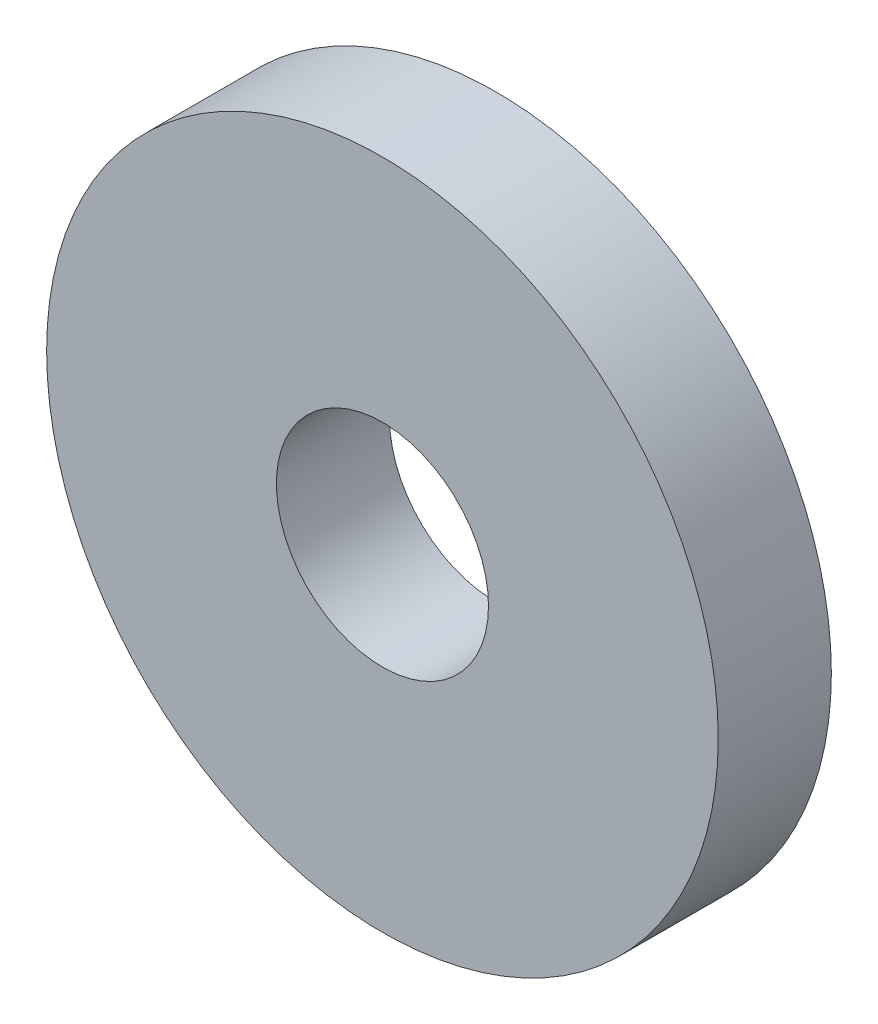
ISO-10303-21;
HEADER;
FILE_DESCRIPTION(('STEP AP214'),'2;1');
FILE_NAME('part.step','',(''),(''),'','','');
FILE_SCHEMA(('AUTOMOTIVE_DESIGN { 1 0 10303 214 1 1 1 1 }'));
ENDSEC;
DATA;
#1=APPLICATION_CONTEXT('core data for automotive mechanical design processes');
#2=APPLICATION_PROTOCOL_DEFINITION('international standard','automotive_design',2000,#1);
#3=PRODUCT_CONTEXT('',#1,'mechanical');
#4=PRODUCT('Part','Part','',(#3));
#5=PRODUCT_RELATED_PRODUCT_CATEGORY('part','',(#4));
#6=PRODUCT_DEFINITION_FORMATION('','',#4);
#7=PRODUCT_DEFINITION_CONTEXT('part definition',#1,'design');
#8=PRODUCT_DEFINITION('design','',#6,#7);
#9=PRODUCT_DEFINITION_SHAPE('','',#8);
#10=(LENGTH_UNIT() NAMED_UNIT(*) SI_UNIT(.MILLI.,.METRE.));
#11=(NAMED_UNIT(*) PLANE_ANGLE_UNIT() SI_UNIT($,.RADIAN.));
#12=(NAMED_UNIT(*) SI_UNIT($,.STERADIAN.) SOLID_ANGLE_UNIT());
#13=UNCERTAINTY_MEASURE_WITH_UNIT(LENGTH_MEASURE(1.E-05),#10,'distance_accuracy_value','');
#14=(GEOMETRIC_REPRESENTATION_CONTEXT(3) GLOBAL_UNCERTAINTY_ASSIGNED_CONTEXT((#13)) GLOBAL_UNIT_ASSIGNED_CONTEXT((#10,
#11,#12)) REPRESENTATION_CONTEXT('',''));
#15=CARTESIAN_POINT('',(0.,0.,0.));
#16=DIRECTION('',(0.,0.,1.));
#17=DIRECTION('',(1.,0.,0.));
#18=AXIS2_PLACEMENT_3D('',#15,#16,#17);
#19=CARTESIAN_POINT('',(0.,0.,3.2));
#20=DIRECTION('',(0.,0.,1.));
#21=DIRECTION('',(1.,0.,0.));
#22=AXIS2_PLACEMENT_3D('',#19,#20,#21);
#23=PLANE('',#22);
#24=CARTESIAN_POINT('',(0.,0.,3.2));
#25=DIRECTION('',(0.,0.,1.));
#26=DIRECTION('',(1.,0.,0.));
#27=AXIS2_PLACEMENT_3D('',#24,#25,#26);
#28=CIRCLE('',#27,6.);
#29=CARTESIAN_POINT('',(6.,0.,3.2));
#30=VERTEX_POINT('',#29);
#31=EDGE_CURVE('E30',#30,#30,#28,.T.);
#32=ORIENTED_EDGE('',*,*,#31,.F.);
#33=EDGE_LOOP('',(#32));
#34=FACE_BOUND('',#33,.T.);
#35=CARTESIAN_POINT('',(0.,0.,3.2));
#36=DIRECTION('',(0.,0.,-1.));
#37=DIRECTION('',(-1.,0.,0.));
#38=AXIS2_PLACEMENT_3D('',#35,#36,#37);
#39=CIRCLE('',#38,19.);
#40=CARTESIAN_POINT('',(-19.,0.,3.2));
#41=VERTEX_POINT('',#40);
#42=EDGE_CURVE('E10',#41,#41,#39,.T.);
#43=ORIENTED_EDGE('',*,*,#42,.F.);
#44=EDGE_LOOP('',(#43));
#45=FACE_BOUND('',#44,.T.);
#46=ADVANCED_FACE('F15',(#34,#45),#23,.T.);
#47=CARTESIAN_POINT('',(0.,0.,-3.2));
#48=DIRECTION('',(0.,0.,-1.));
#49=DIRECTION('',(-1.,0.,0.));
#50=AXIS2_PLACEMENT_3D('',#47,#48,#49);
#51=PLANE('',#50);
#52=CARTESIAN_POINT('',(0.,0.,-3.2));
#53=DIRECTION('',(0.,0.,-1.));
#54=DIRECTION('',(-1.,0.,0.));
#55=AXIS2_PLACEMENT_3D('',#52,#53,#54);
#56=CIRCLE('',#55,6.);
#57=CARTESIAN_POINT('',(-6.,0.,-3.2));
#58=VERTEX_POINT('',#57);
#59=EDGE_CURVE('E19',#58,#58,#56,.T.);
#60=ORIENTED_EDGE('',*,*,#59,.F.);
#61=EDGE_LOOP('',(#60));
#62=FACE_BOUND('',#61,.T.);
#63=CARTESIAN_POINT('',(0.,0.,-3.2));
#64=DIRECTION('',(0.,0.,1.));
#65=DIRECTION('',(1.,0.,0.));
#66=AXIS2_PLACEMENT_3D('',#63,#64,#65);
#67=CIRCLE('',#66,19.);
#68=CARTESIAN_POINT('',(19.,0.,-3.2));
#69=VERTEX_POINT('',#68);
#70=EDGE_CURVE('E23',#69,#69,#67,.T.);
#71=ORIENTED_EDGE('',*,*,#70,.F.);
#72=EDGE_LOOP('',(#71));
#73=FACE_BOUND('',#72,.T.);
#74=ADVANCED_FACE('F36',(#62,#73),#51,.T.);
#75=CARTESIAN_POINT('',(0.,0.,-3.2));
#76=DIRECTION('',(0.,0.,1.));
#77=DIRECTION('',(1.,0.,0.));
#78=AXIS2_PLACEMENT_3D('',#75,#76,#77);
#79=CYLINDRICAL_SURFACE('',#78,19.);
#80=ORIENTED_EDGE('',*,*,#42,.T.);
#81=EDGE_LOOP('',(#80));
#82=FACE_BOUND('',#81,.T.);
#83=ORIENTED_EDGE('',*,*,#70,.T.);
#84=EDGE_LOOP('',(#83));
#85=FACE_BOUND('',#84,.T.);
#86=ADVANCED_FACE('F17',(#82,#85),#79,.T.);
#87=CARTESIAN_POINT('',(0.,0.,-4.2));
#88=DIRECTION('',(0.,0.,1.));
#89=DIRECTION('',(1.,0.,0.));
#90=AXIS2_PLACEMENT_3D('',#87,#88,#89);
#91=CYLINDRICAL_SURFACE('',#90,6.);
#92=ORIENTED_EDGE('',*,*,#31,.T.);
#93=EDGE_LOOP('',(#92));
#94=FACE_BOUND('',#93,.T.);
#95=ORIENTED_EDGE('',*,*,#59,.T.);
#96=EDGE_LOOP('',(#95));
#97=FACE_BOUND('',#96,.T.);
#98=ADVANCED_FACE('F38',(#94,#97),#91,.F.);
#99=CLOSED_SHELL('',(#46,#74,#86,#98));
#100=MANIFOLD_SOLID_BREP('B1',#99);
#101=ADVANCED_BREP_SHAPE_REPRESENTATION('',(#18,#100),#14);
#102=SHAPE_DEFINITION_REPRESENTATION(#9,#101);
ENDSEC;
END-ISO-10303-21;
